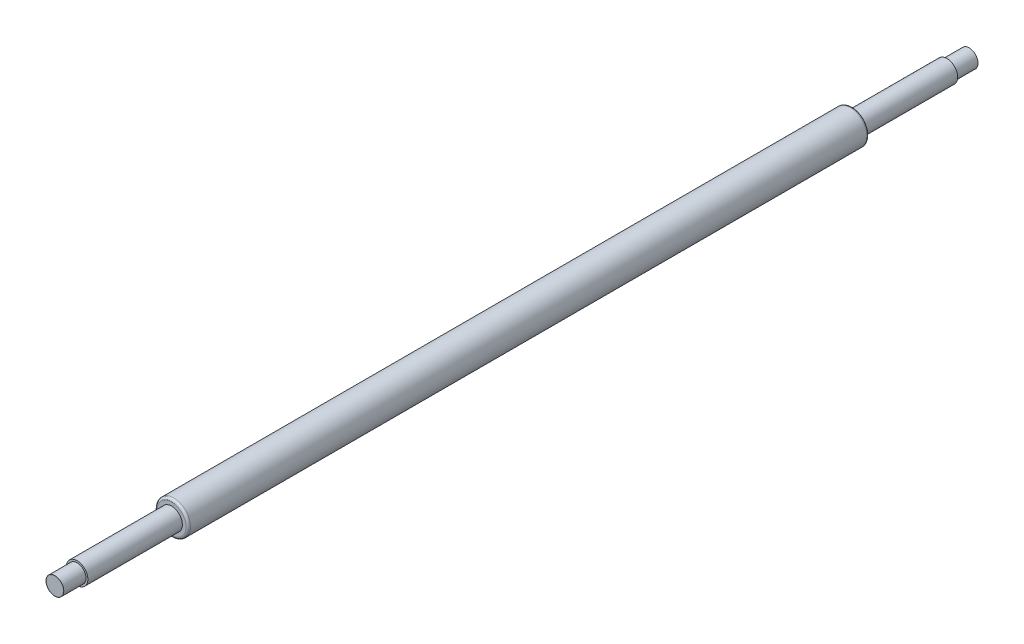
from build123d import *

# Parameters (mm, degrees)
SKETCH1_R           = 9.525
BOSS_EXTRUDE1_DEPTH = 522.224
CUT_EXTRUDE1_START  = -66.675
SKETCH2_R           = 9.525
SKETCH2_R_2         = 6.1595
CUT_EXTRUDE1_DEPTH  = 66.675
SKETCH3_R           = 9.525
SKETCH3_R_2         = 6.1595
CUT_EXTRUDE2_DEPTH  = 66.675
FILLET1_R           = 1.27
SKETCH4_R           = 6.1595
SKETCH4_R_2         = 5.08
CUT_EXTRUDE3_DEPTH  = 12.7
CUT_EXTRUDE4_START  = -12.7
SKETCH5_R           = 6.1595
SKETCH5_R_2         = 5.08
CUT_EXTRUDE4_DEPTH  = 12.7


with BuildPart() as part:
    # Sketch1 → Boss-Extrude1 (new body)
    with BuildSketch(Plane.XY):
        Circle(SKETCH1_R)
    extrude(amount=BOSS_EXTRUDE1_DEPTH)

    # Sketch2 → Cut-Extrude1 (cut)
    with BuildSketch(Plane.XY.offset(522.224).offset(CUT_EXTRUDE1_START)):
        Circle(SKETCH2_R)
        Circle(SKETCH2_R_2, mode=Mode.SUBTRACT)
    extrude(amount=CUT_EXTRUDE1_DEPTH, mode=Mode.SUBTRACT)

    # Sketch3 → Cut-Extrude2 (cut)
    with BuildSketch(Plane(origin=(0, 0, 0), x_dir=(-1, 0, 0), z_dir=(0, 0, -1))):
        Circle(SKETCH3_R)
        with Locations(Location((0, 0, 0), (0, 0, 180))):
            Circle(SKETCH3_R_2, mode=Mode.SUBTRACT)
    extrude(amount=-CUT_EXTRUDE2_DEPTH, mode=Mode.SUBTRACT)

    # Fillet1
    fillet1_edges = [part.edges().sort_by_distance(p)[0] for p in [
        (-9.525, 0, 66.675),
        (-6.1595, 0, 0),
        (-9.525, 0, 455.549),
        (-6.1595, 0, 522.224),
    ]]
    fillet(fillet1_edges, radius=FILLET1_R)

    # Sketch4 → Cut-Extrude3 (cut)
    with BuildSketch(Plane(origin=(0, 0, 0), x_dir=(-1, 0, 0), z_dir=(0, 0, -1))):
        Circle(SKETCH4_R)
        Circle(SKETCH4_R_2, mode=Mode.SUBTRACT)
    extrude(amount=-CUT_EXTRUDE3_DEPTH, mode=Mode.SUBTRACT)

    # Sketch5 → Cut-Extrude4 (cut)
    with BuildSketch(Plane.XY.offset(522.224).offset(CUT_EXTRUDE4_START)):
        Circle(SKETCH5_R)
        with Locations(Location((0, 0, 0), (0, 0, 180))):
            Circle(SKETCH5_R_2, mode=Mode.SUBTRACT)
    extrude(amount=CUT_EXTRUDE4_DEPTH, mode=Mode.SUBTRACT)


solid = part.part
